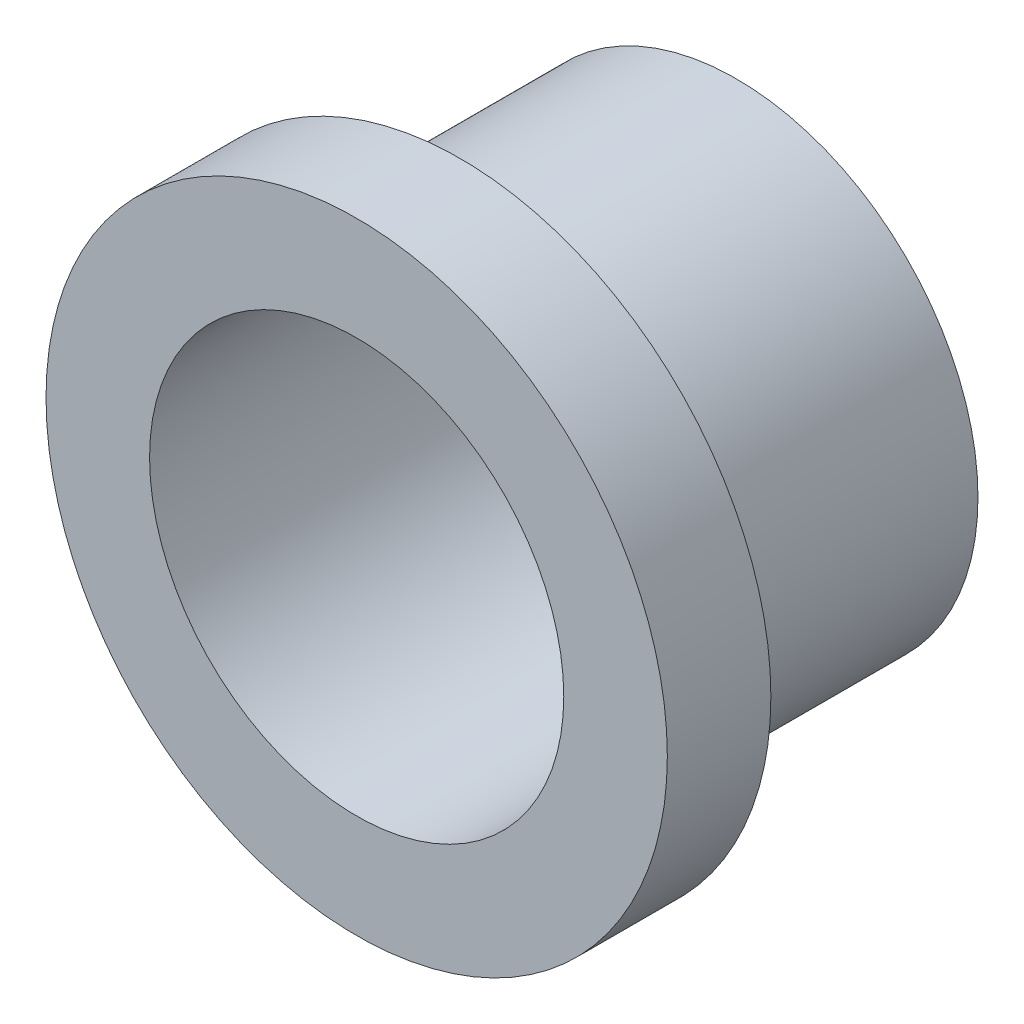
from build123d import *

# Parameters (mm, degrees)
SKETCH2_R                  = 7
BOSS_EXTRUDE1_DEPTH        = 8
SKETCH3_R                  = 9
BOSS_EXTRUDE2_DEPTH        = 3
F_12_0MM_DOWEL_HOLE1_D     = 12
F_12_0MM_DOWEL_HOLE1_DEPTH = 14
F_12_0MM_DOWEL_HOLE1_TIP   = 3.605163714


with BuildPart() as part:
    # Sketch2 → Boss-Extrude1 (new body)
    with BuildSketch(Plane.XY):
        Circle(SKETCH2_R)
    extrude(amount=BOSS_EXTRUDE1_DEPTH)

    # Sketch3 → Boss-Extrude2 (add)
    with BuildSketch(Plane.XY.offset(8)):
        Circle(SKETCH3_R)
    extrude(amount=BOSS_EXTRUDE2_DEPTH)

    # 12.0mm Dowel Hole1
    with Locations(Plane.XY.offset(11)):
        with Locations((0, 0)):
            Hole(F_12_0MM_DOWEL_HOLE1_D / 2, depth=F_12_0MM_DOWEL_HOLE1_DEPTH)
            with Locations((0, 0, -(F_12_0MM_DOWEL_HOLE1_DEPTH + F_12_0MM_DOWEL_HOLE1_TIP / 2))):  # 118° drill point
                Cone(0, F_12_0MM_DOWEL_HOLE1_D / 2, F_12_0MM_DOWEL_HOLE1_TIP, mode=Mode.SUBTRACT)


solid = part.part
